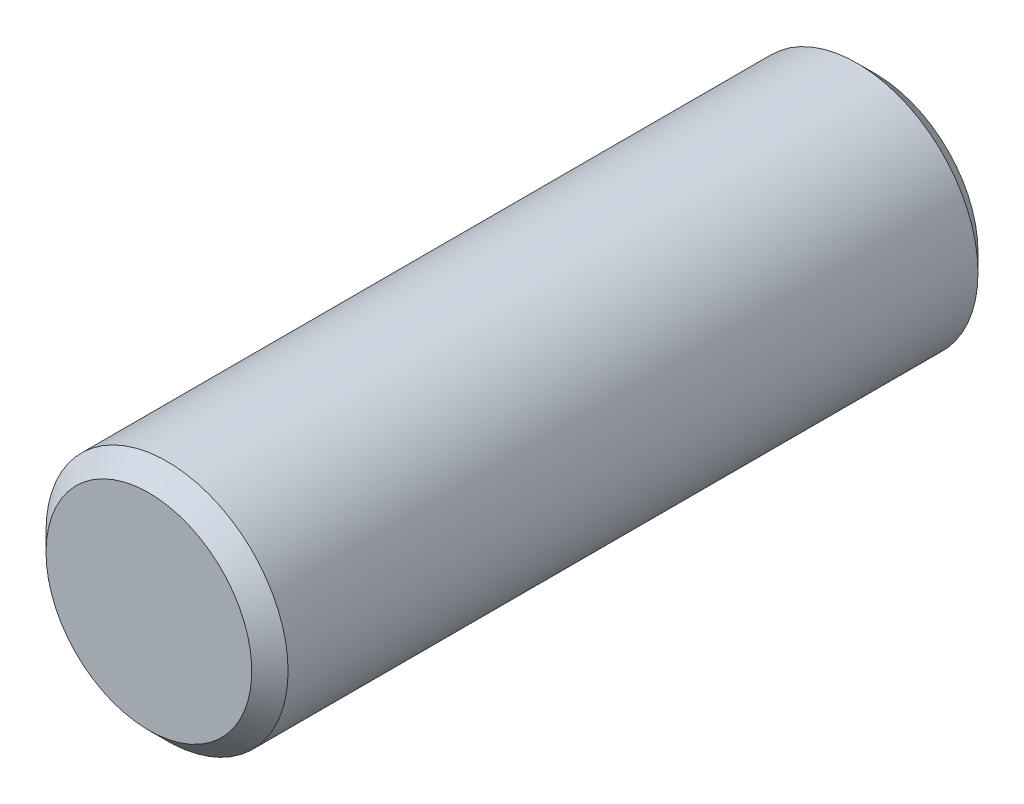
ISO-10303-21;
HEADER;
FILE_DESCRIPTION(('STEP AP214'),'2;1');
FILE_NAME('part.step','',(''),(''),'','','');
FILE_SCHEMA(('AUTOMOTIVE_DESIGN { 1 0 10303 214 1 1 1 1 }'));
ENDSEC;
DATA;
#1=APPLICATION_CONTEXT('core data for automotive mechanical design processes');
#2=APPLICATION_PROTOCOL_DEFINITION('international standard','automotive_design',2000,#1);
#3=PRODUCT_CONTEXT('',#1,'mechanical');
#4=PRODUCT('Part','Part','',(#3));
#5=PRODUCT_RELATED_PRODUCT_CATEGORY('part','',(#4));
#6=PRODUCT_DEFINITION_FORMATION('','',#4);
#7=PRODUCT_DEFINITION_CONTEXT('part definition',#1,'design');
#8=PRODUCT_DEFINITION('design','',#6,#7);
#9=PRODUCT_DEFINITION_SHAPE('','',#8);
#10=(LENGTH_UNIT() NAMED_UNIT(*) SI_UNIT(.MILLI.,.METRE.));
#11=(NAMED_UNIT(*) PLANE_ANGLE_UNIT() SI_UNIT($,.RADIAN.));
#12=(NAMED_UNIT(*) SI_UNIT($,.STERADIAN.) SOLID_ANGLE_UNIT());
#13=UNCERTAINTY_MEASURE_WITH_UNIT(LENGTH_MEASURE(1.E-05),#10,'distance_accuracy_value','');
#14=(GEOMETRIC_REPRESENTATION_CONTEXT(3) GLOBAL_UNCERTAINTY_ASSIGNED_CONTEXT((#13)) GLOBAL_UNIT_ASSIGNED_CONTEXT((#10,
#11,#12)) REPRESENTATION_CONTEXT('',''));
#15=CARTESIAN_POINT('',(0.,0.,0.));
#16=DIRECTION('',(0.,0.,1.));
#17=DIRECTION('',(1.,0.,0.));
#18=AXIS2_PLACEMENT_3D('',#15,#16,#17);
#19=CARTESIAN_POINT('',(0.,0.,12.));
#20=DIRECTION('',(0.,0.,-1.));
#21=DIRECTION('',(-1.,0.,0.));
#22=AXIS2_PLACEMENT_3D('',#19,#20,#21);
#23=PLANE('',#22);
#24=CARTESIAN_POINT('',(0.,0.,12.0000000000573));
#25=DIRECTION('',(0.,0.,-1.));
#26=DIRECTION('',(-1.,0.,0.));
#27=AXIS2_PLACEMENT_3D('',#24,#25,#26);
#28=CIRCLE('',#27,1.7000000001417);
#29=CARTESIAN_POINT('',(-1.7000000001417,0.,12.0000000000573));
#30=VERTEX_POINT('',#29);
#31=EDGE_CURVE('E18',#30,#30,#28,.T.);
#32=ORIENTED_EDGE('',*,*,#31,.F.);
#33=EDGE_LOOP('',(#32));
#34=FACE_BOUND('',#33,.T.);
#35=ADVANCED_FACE('F15',(#34),#23,.F.);
#36=CARTESIAN_POINT('',(0.,0.,0.));
#37=DIRECTION('',(0.,0.,-1.));
#38=DIRECTION('',(-1.,0.,0.));
#39=AXIS2_PLACEMENT_3D('',#36,#37,#38);
#40=PLANE('',#39);
#41=CARTESIAN_POINT('',(0.,0.,-1.13686837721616E-10));
#42=DIRECTION('',(0.,0.,1.));
#43=DIRECTION('',(1.,0.,0.));
#44=AXIS2_PLACEMENT_3D('',#41,#42,#43);
#45=CIRCLE('',#44,1.70000000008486);
#46=CARTESIAN_POINT('',(1.70000000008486,0.,-1.13686837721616E-10));
#47=VERTEX_POINT('',#46);
#48=EDGE_CURVE('E27',#47,#47,#45,.T.);
#49=ORIENTED_EDGE('',*,*,#48,.F.);
#50=EDGE_LOOP('',(#49));
#51=FACE_BOUND('',#50,.T.);
#52=ADVANCED_FACE('F42',(#51),#40,.T.);
#53=CARTESIAN_POINT('',(0.,0.,11.6999999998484));
#54=DIRECTION('',(0.,0.,-1.));
#55=DIRECTION('',(-1.,0.,0.));
#56=AXIS2_PLACEMENT_3D('',#53,#54,#55);
#57=CONICAL_SURFACE('',#56,1.99999999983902,0.785398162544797);
#58=CARTESIAN_POINT('',(0.,0.,11.7));
#59=DIRECTION('',(0.,0.,1.));
#60=DIRECTION('',(1.,0.,0.));
#61=AXIS2_PLACEMENT_3D('',#58,#59,#60);
#62=CIRCLE('',#61,2.);
#63=CARTESIAN_POINT('',(2.,0.,11.7));
#64=VERTEX_POINT('',#63);
#65=EDGE_CURVE('E22',#64,#64,#62,.F.);
#66=ORIENTED_EDGE('',*,*,#65,.F.);
#67=EDGE_LOOP('',(#66));
#68=FACE_BOUND('',#67,.T.);
#69=ORIENTED_EDGE('',*,*,#31,.T.);
#70=EDGE_LOOP('',(#69));
#71=FACE_BOUND('',#70,.T.);
#72=ADVANCED_FACE('F39',(#68,#71),#57,.T.);
#73=CARTESIAN_POINT('',(0.,0.,0.300000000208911));
#74=DIRECTION('',(0.,0.,1.));
#75=DIRECTION('',(1.,0.,0.));
#76=AXIS2_PLACEMENT_3D('',#73,#74,#75);
#77=CONICAL_SURFACE('',#76,1.99999999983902,0.785398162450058);
#78=ORIENTED_EDGE('',*,*,#48,.T.);
#79=EDGE_LOOP('',(#78));
#80=FACE_BOUND('',#79,.T.);
#81=CARTESIAN_POINT('',(0.,0.,0.3));
#82=DIRECTION('',(0.,0.,1.));
#83=DIRECTION('',(1.,0.,0.));
#84=AXIS2_PLACEMENT_3D('',#81,#82,#83);
#85=CIRCLE('',#84,2.);
#86=CARTESIAN_POINT('',(2.,0.,0.3));
#87=VERTEX_POINT('',#86);
#88=EDGE_CURVE('E10',#87,#87,#85,.T.);
#89=ORIENTED_EDGE('',*,*,#88,.F.);
#90=EDGE_LOOP('',(#89));
#91=FACE_BOUND('',#90,.T.);
#92=ADVANCED_FACE('F50',(#80,#91),#77,.T.);
#93=CARTESIAN_POINT('',(0.,0.,0.));
#94=DIRECTION('',(0.,0.,1.));
#95=DIRECTION('',(1.,0.,0.));
#96=AXIS2_PLACEMENT_3D('',#93,#94,#95);
#97=CYLINDRICAL_SURFACE('',#96,2.);
#98=ORIENTED_EDGE('',*,*,#88,.T.);
#99=EDGE_LOOP('',(#98));
#100=FACE_BOUND('',#99,.T.);
#101=ORIENTED_EDGE('',*,*,#65,.T.);
#102=EDGE_LOOP('',(#101));
#103=FACE_BOUND('',#102,.T.);
#104=ADVANCED_FACE('F48',(#100,#103),#97,.T.);
#105=CLOSED_SHELL('',(#35,#52,#72,#92,#104));
#106=MANIFOLD_SOLID_BREP('B1',#105);
#107=ADVANCED_BREP_SHAPE_REPRESENTATION('',(#18,#106),#14);
#108=SHAPE_DEFINITION_REPRESENTATION(#9,#107);
ENDSEC;
END-ISO-10303-21;
